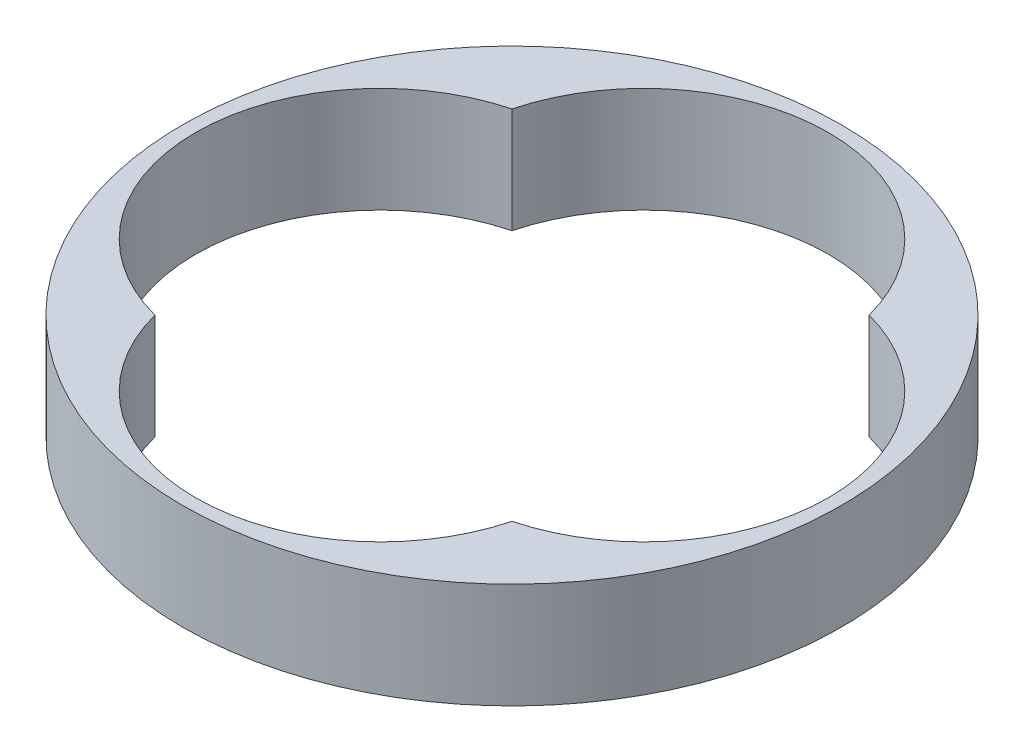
from build123d import *

# Parameters (mm, degrees)
SKETCH1_R           = 62.5
BOSS_EXTRUDE1_DEPTH = 20
SKETCH2_R           = 35
CUT_EXTRUDE1_DEPTH  = 91.622844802


with BuildPart() as part:
    # Sketch1 → Boss-Extrude1 (new body)
    with BuildSketch(Plane(origin=(0, 0, 0), x_dir=(1, 0, 0), z_dir=(0, 1, 0))):
        with Locations(Location((0, 0, 0), (0, 0, 270))):
            Circle(SKETCH1_R)
    extrude(amount=BOSS_EXTRUDE1_DEPTH)

    # Sketch2 → Cut-Extrude1 (cut, through all)
    with BuildSketch(Plane(origin=(0, 20, 0), x_dir=(1, 0, 0), z_dir=(0, 1, 0))):
        with Locations((0, 25)):
            Circle(SKETCH2_R)
        with Locations((25, 0)):
            Circle(SKETCH2_R)
        with Locations((0, -25)):
            Circle(SKETCH2_R)
        with Locations((-25, 0)):
            Circle(SKETCH2_R)
    extrude(amount=-CUT_EXTRUDE1_DEPTH, mode=Mode.SUBTRACT)


solid = part.part
